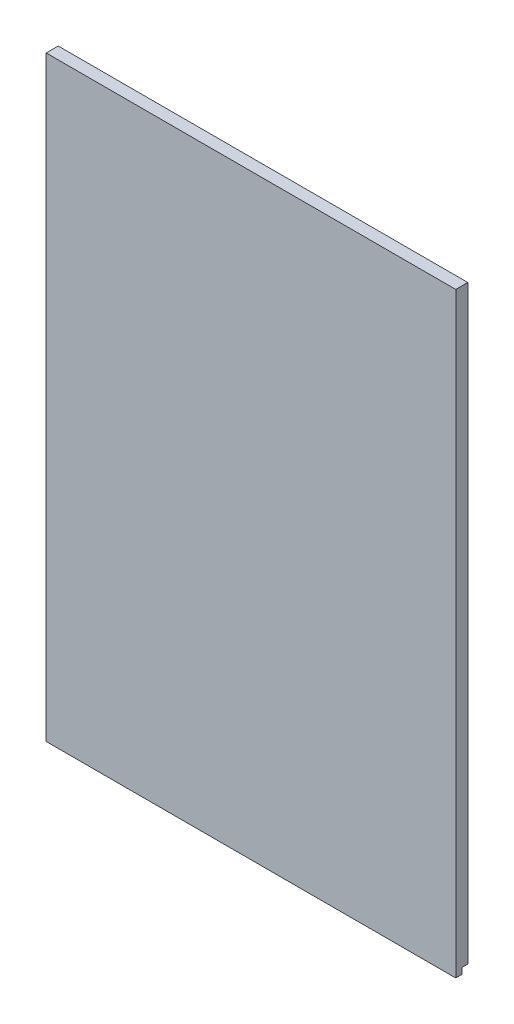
from build123d import *

# Parameters (mm, degrees)
SKIZZE1_W                       = 68
SKIZZE1_H                       = 98
AUFSATZ_LINEAR_AUSTRAGEN1_DEPTH = 2
SKIZZE2_W                       = 2
SKIZZE2_H                       = 2
SCHNITT_LINEAR_AUSTRAGEN1_DEPTH = 1
VERRUNDUNG2_R                   = 0.2
SKIZZE3_W                       = 68
SKIZZE3_H                       = 1
AUFSATZ_LINEAR_AUSTRAGEN2_DEPTH = 1


with BuildPart() as part:
    # Skizze1 → Aufsatz-Linear austragen1 (new body)
    with BuildSketch(Plane.XY):
        with Locations((34, 49)):
            Rectangle(SKIZZE1_W, SKIZZE1_H)
    extrude(amount=AUFSATZ_LINEAR_AUSTRAGEN1_DEPTH)

    # Skizze2 → Schnitt-Linear austragen1 (cut)
    with BuildSketch(Plane(origin=(0, 0, 0), x_dir=(-1, 0, 0), z_dir=(0, 0, -1))):
        with Locations((-3, 95)):
            Rectangle(SKIZZE2_W, SKIZZE2_H)
        with Locations((-3, 3)):
            Rectangle(SKIZZE2_W, SKIZZE2_H)
        with Locations((-65, 95)):
            Rectangle(SKIZZE2_W, SKIZZE2_H)
        with Locations((-57, 3)):
            Rectangle(SKIZZE2_W, SKIZZE2_H)
    extrude(amount=-SCHNITT_LINEAR_AUSTRAGEN1_DEPTH, mode=Mode.SUBTRACT)

    # Verrundung2
    verrundung2_edges = [part.edges().sort_by_distance(p)[0] for p in [
        (4, 3, 1),
        (4, 2, 0.5),
        (3, 4, 1),
        (4, 4, 0.5),
        (2, 3, 1),
        (2, 4, 0.5),
        (3, 2, 1),
        (2, 2, 0.5),
        (4, 3, 0),
        (3, 2, 0),
        (2, 3, 0),
        (3, 4, 0),
        (64, 95, 1),
        (64, 96, 0.5),
        (65, 94, 1),
        (64, 94, 0.5),
        (66, 95, 1),
        (66, 94, 0.5),
        (65, 96, 1),
        (66, 96, 0.5),
        (64, 95, 0),
        (65, 96, 0),
        (66, 95, 0),
        (65, 94, 0),
        (57, 2, 1),
        (56, 2, 0.5),
        (58, 3, 1),
        (58, 2, 0.5),
        (57, 4, 1),
        (58, 4, 0.5),
        (56, 3, 1),
        (57, 2, 0),
        (56, 3, 0),
        (57, 4, 0),
        (58, 3, 0),
        (4, 95, 1),
        (4, 94, 0.5),
        (3, 96, 1),
        (4, 96, 0.5),
        (2, 95, 1),
        (2, 96, 0.5),
        (3, 94, 1),
        (2, 94, 0.5),
        (4, 95, 0),
        (3, 94, 0),
        (2, 95, 0),
        (3, 96, 0),
    ]]
    fillet(verrundung2_edges, radius=VERRUNDUNG2_R)

    # Skizze3 → Aufsatz-Linear austragen2 (add)
    with BuildSketch(Plane.XZ):
        with Locations((34, 1.5)):
            Rectangle(SKIZZE3_W, SKIZZE3_H)
    extrude(amount=AUFSATZ_LINEAR_AUSTRAGEN2_DEPTH)


solid = part.part
